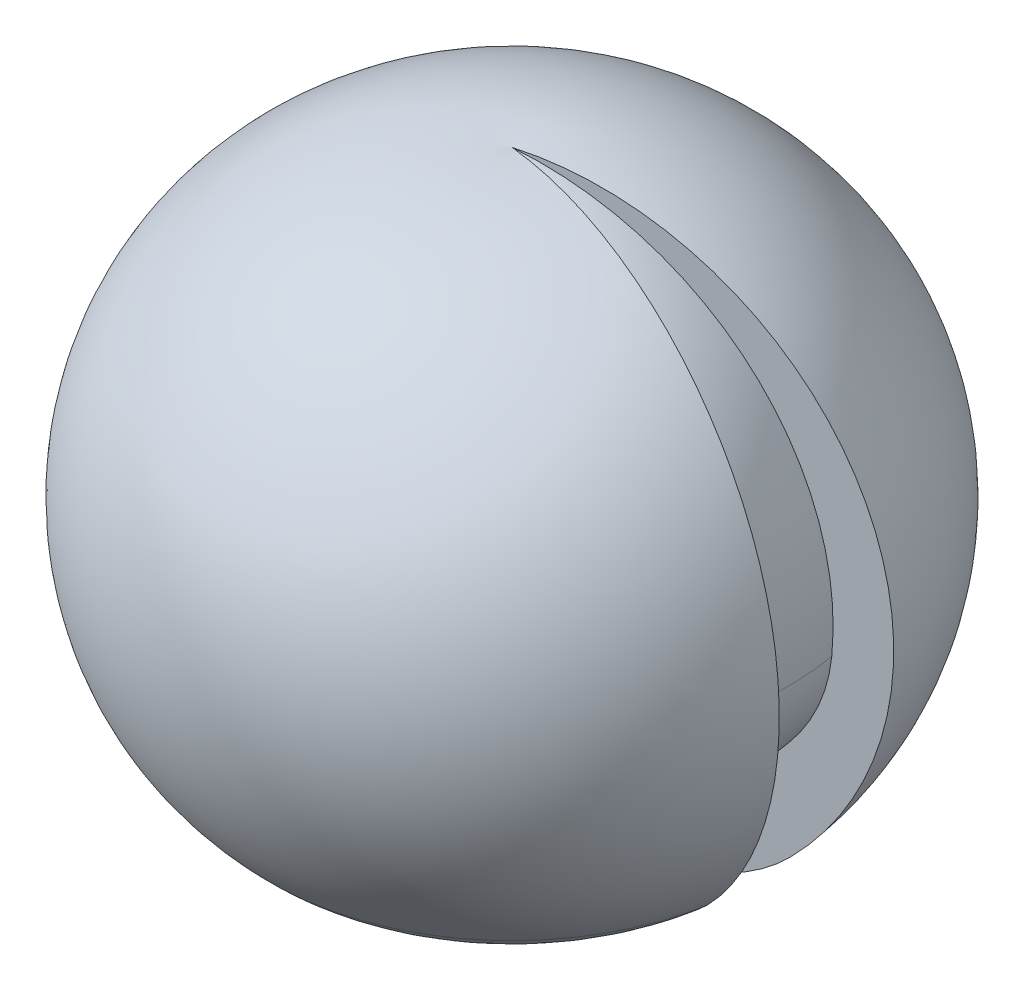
from build123d import *

# Parameters (mm, degrees)
REVOLVE1_ANGLE = 340
REVOLVE2_ANGLE = 340


with BuildPart() as part:
    # Sketch10 → Revolve1 (revolve, symmetric)
    with BuildSketch(Plane.XY) as revolve1_sk:
        with BuildLine():
            Line((0, -21.003727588), (0, 197.127471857))
            ThreePointArc((0, 197.127471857), (-224.829117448, 354.231276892), (-20.980257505, 537.739805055))
            ThreePointArc((-20.980257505, 537.739805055), (-10.782178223, 549.585119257), (0, 560.901343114))
            Line((0, 560.901343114), (0, 942.840808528))
            ThreePointArc((0, 942.840808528), (-575.775186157, 609.868237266), (-460.121933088, -45.121933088))
            ThreePointArc((-460.121933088, -45.121933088), (-224.691841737, -135.493837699), (0, -21.003727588))
        make_face()
    revolve(axis=Axis((0, -21.003727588, 0), (0, 1, 0)), revolution_arc=REVOLVE1_ANGLE / 2)
    revolve(revolve1_sk.sketch, axis=Axis((0, -21.003727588, 0), (0, -1, 0)), revolution_arc=REVOLVE1_ANGLE / 2)

    # Sketch11 → Revolve2 (revolve, symmetric)
    with BuildSketch(Plane.XY) as revolve2_sk:
        with BuildLine():
            Line((0, -21.003727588), (0, 197.127471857))
            ThreePointArc((0, 197.127471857), (33.645755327, 211.102068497), (63.672836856, 231.734581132))
            ThreePointArc((63.672836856, 231.734581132), (59.688203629, 98.34867421), (0, -21.003727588))
        make_face()
        with BuildLine():
            Line((0, 560.901343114), (0, 942.840808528))
            ThreePointArc((0, 942.840808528), (394.128185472, 738.028356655), (527.792924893, 314.449669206))
            ThreePointArc((527.792924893, 314.449669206), (398.369308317, 88.650209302), (142.498303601, 41.048764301))
            ThreePointArc((142.498303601, 41.048764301), (325.394925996, 332.15719963), (195.82736356, 650.60270889))
            ThreePointArc((195.82736356, 650.60270889), (89.872460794, 623.306843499), (0, 560.901343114))
        make_face()
    revolve(axis=Axis((0, 560.901343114, 0), (0, 1, 0)), revolution_arc=REVOLVE2_ANGLE / 2)
    revolve(revolve2_sk.sketch, axis=Axis((0, 560.901343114, 0), (0, -1, 0)), revolution_arc=REVOLVE2_ANGLE / 2)


solid = part.part
